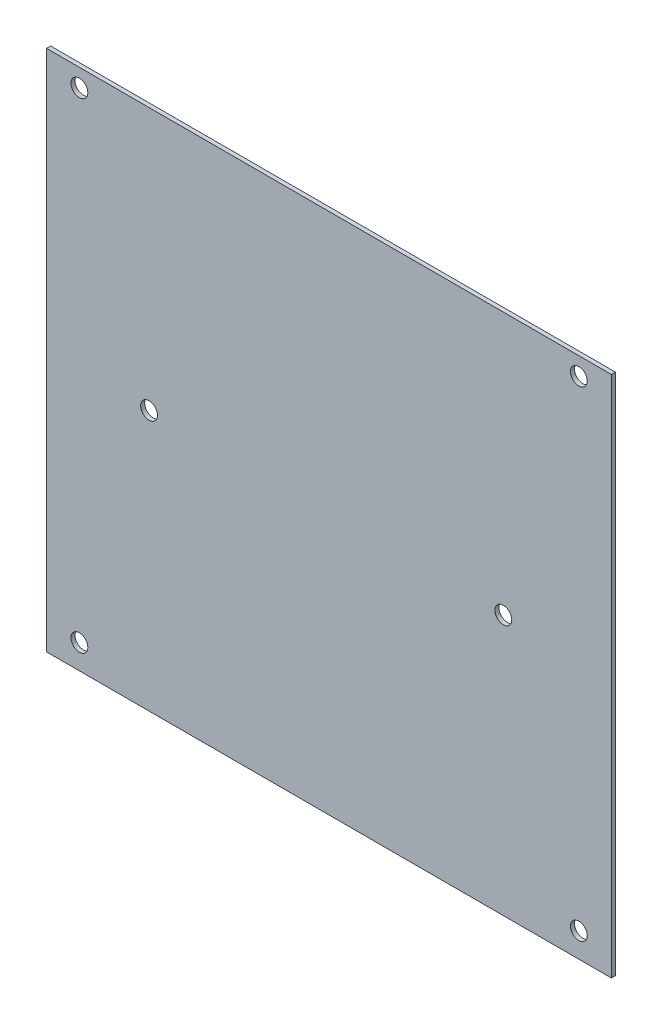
ISO-10303-21;
HEADER;
FILE_DESCRIPTION(('STEP AP214'),'2;1');
FILE_NAME('part.step','',(''),(''),'','','');
FILE_SCHEMA(('AUTOMOTIVE_DESIGN { 1 0 10303 214 1 1 1 1 }'));
ENDSEC;
DATA;
#1=APPLICATION_CONTEXT('core data for automotive mechanical design processes');
#2=APPLICATION_PROTOCOL_DEFINITION('international standard','automotive_design',2000,#1);
#3=PRODUCT_CONTEXT('',#1,'mechanical');
#4=PRODUCT('Part','Part','',(#3));
#5=PRODUCT_RELATED_PRODUCT_CATEGORY('part','',(#4));
#6=PRODUCT_DEFINITION_FORMATION('','',#4);
#7=PRODUCT_DEFINITION_CONTEXT('part definition',#1,'design');
#8=PRODUCT_DEFINITION('design','',#6,#7);
#9=PRODUCT_DEFINITION_SHAPE('','',#8);
#10=(LENGTH_UNIT() NAMED_UNIT(*) SI_UNIT(.MILLI.,.METRE.));
#11=(NAMED_UNIT(*) PLANE_ANGLE_UNIT() SI_UNIT($,.RADIAN.));
#12=(NAMED_UNIT(*) SI_UNIT($,.STERADIAN.) SOLID_ANGLE_UNIT());
#13=UNCERTAINTY_MEASURE_WITH_UNIT(LENGTH_MEASURE(1.E-05),#10,'distance_accuracy_value','');
#14=(GEOMETRIC_REPRESENTATION_CONTEXT(3) GLOBAL_UNCERTAINTY_ASSIGNED_CONTEXT((#13)) GLOBAL_UNIT_ASSIGNED_CONTEXT((#10,
#11,#12)) REPRESENTATION_CONTEXT('',''));
#15=CARTESIAN_POINT('',(0.,0.,0.));
#16=DIRECTION('',(0.,0.,1.));
#17=DIRECTION('',(1.,0.,0.));
#18=AXIS2_PLACEMENT_3D('',#15,#16,#17);
#19=CARTESIAN_POINT('',(0.,0.,2.));
#20=DIRECTION('',(-1.,0.,0.));
#21=DIRECTION('',(0.,0.,1.));
#22=AXIS2_PLACEMENT_3D('',#19,#20,#21);
#23=PLANE('',#22);
#24=DIRECTION('',(0.,-1.,0.));
#25=VECTOR('',#24,1.);
#26=CARTESIAN_POINT('',(0.,90.,0.700000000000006));
#27=LINE('',#26,#25);
#28=CARTESIAN_POINT('',(0.,90.,0.700000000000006));
#29=VERTEX_POINT('',#28);
#30=CARTESIAN_POINT('',(0.,0.,0.700000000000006));
#31=VERTEX_POINT('',#30);
#32=EDGE_CURVE('E77',#29,#31,#27,.T.);
#33=ORIENTED_EDGE('',*,*,#32,.F.);
#34=DIRECTION('',(0.,0.,-1.));
#35=VECTOR('',#34,1.);
#36=CARTESIAN_POINT('',(0.,90.,2.));
#37=LINE('',#36,#35);
#38=CARTESIAN_POINT('',(0.,90.,0.));
#39=VERTEX_POINT('',#38);
#40=EDGE_CURVE('E37',#29,#39,#37,.T.);
#41=ORIENTED_EDGE('',*,*,#40,.T.);
#42=DIRECTION('',(0.,1.,0.));
#43=VECTOR('',#42,1.);
#44=CARTESIAN_POINT('',(0.,0.,0.));
#45=LINE('',#44,#43);
#46=CARTESIAN_POINT('',(0.,0.,0.));
#47=VERTEX_POINT('',#46);
#48=EDGE_CURVE('E98',#47,#39,#45,.T.);
#49=ORIENTED_EDGE('',*,*,#48,.F.);
#50=DIRECTION('',(0.,0.,-1.));
#51=VECTOR('',#50,1.);
#52=CARTESIAN_POINT('',(0.,0.,2.));
#53=LINE('',#52,#51);
#54=EDGE_CURVE('E12',#31,#47,#53,.T.);
#55=ORIENTED_EDGE('',*,*,#54,.F.);
#56=EDGE_LOOP('',(#33,#41,#49,#55));
#57=FACE_BOUND('',#56,.T.);
#58=ADVANCED_FACE('F34',(#57),#23,.T.);
#59=CARTESIAN_POINT('',(0.,0.,2.));
#60=DIRECTION('',(0.,1.,0.));
#61=DIRECTION('',(0.,0.,1.));
#62=AXIS2_PLACEMENT_3D('',#59,#60,#61);
#63=PLANE('',#62);
#64=DIRECTION('',(0.,0.,-1.));
#65=VECTOR('',#64,1.);
#66=CARTESIAN_POINT('',(97.25,0.,2.));
#67=LINE('',#66,#65);
#68=CARTESIAN_POINT('',(97.25,0.,0.700000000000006));
#69=VERTEX_POINT('',#68);
#70=CARTESIAN_POINT('',(97.25,0.,0.));
#71=VERTEX_POINT('',#70);
#72=EDGE_CURVE('E42',#69,#71,#67,.T.);
#73=ORIENTED_EDGE('',*,*,#72,.F.);
#74=DIRECTION('',(1.,0.,0.));
#75=VECTOR('',#74,1.);
#76=CARTESIAN_POINT('',(0.,0.,0.700000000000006));
#77=LINE('',#76,#75);
#78=EDGE_CURVE('E73',#31,#69,#77,.T.);
#79=ORIENTED_EDGE('',*,*,#78,.F.);
#80=ORIENTED_EDGE('',*,*,#54,.T.);
#81=DIRECTION('',(1.,0.,0.));
#82=VECTOR('',#81,1.);
#83=CARTESIAN_POINT('',(0.,0.,0.));
#84=LINE('',#83,#82);
#85=EDGE_CURVE('E88',#47,#71,#84,.T.);
#86=ORIENTED_EDGE('',*,*,#85,.T.);
#87=EDGE_LOOP('',(#73,#79,#80,#86));
#88=FACE_BOUND('',#87,.T.);
#89=ADVANCED_FACE('F87',(#88),#63,.F.);
#90=CARTESIAN_POINT('',(97.25,0.,2.));
#91=DIRECTION('',(-1.,0.,0.));
#92=DIRECTION('',(0.,0.,1.));
#93=AXIS2_PLACEMENT_3D('',#90,#91,#92);
#94=PLANE('',#93);
#95=DIRECTION('',(0.,0.,-1.));
#96=VECTOR('',#95,1.);
#97=CARTESIAN_POINT('',(97.25,90.,2.));
#98=LINE('',#97,#96);
#99=CARTESIAN_POINT('',(97.25,90.,0.700000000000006));
#100=VERTEX_POINT('',#99);
#101=CARTESIAN_POINT('',(97.25,90.,0.));
#102=VERTEX_POINT('',#101);
#103=EDGE_CURVE('E84',#100,#102,#98,.T.);
#104=ORIENTED_EDGE('',*,*,#103,.F.);
#105=DIRECTION('',(0.,1.,0.));
#106=VECTOR('',#105,1.);
#107=CARTESIAN_POINT('',(97.25,90.,0.700000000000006));
#108=LINE('',#107,#106);
#109=EDGE_CURVE('E50',#69,#100,#108,.T.);
#110=ORIENTED_EDGE('',*,*,#109,.F.);
#111=ORIENTED_EDGE('',*,*,#72,.T.);
#112=DIRECTION('',(0.,1.,0.));
#113=VECTOR('',#112,1.);
#114=CARTESIAN_POINT('',(97.25,0.,0.));
#115=LINE('',#114,#113);
#116=EDGE_CURVE('E93',#71,#102,#115,.T.);
#117=ORIENTED_EDGE('',*,*,#116,.T.);
#118=EDGE_LOOP('',(#104,#110,#111,#117));
#119=FACE_BOUND('',#118,.T.);
#120=ADVANCED_FACE('F82',(#119),#94,.F.);
#121=CARTESIAN_POINT('',(0.,90.,2.));
#122=DIRECTION('',(0.,1.,0.));
#123=DIRECTION('',(0.,0.,1.));
#124=AXIS2_PLACEMENT_3D('',#121,#122,#123);
#125=PLANE('',#124);
#126=DIRECTION('',(-1.,0.,0.));
#127=VECTOR('',#126,1.);
#128=CARTESIAN_POINT('',(0.,90.,0.700000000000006));
#129=LINE('',#128,#127);
#130=EDGE_CURVE('E85',#100,#29,#129,.T.);
#131=ORIENTED_EDGE('',*,*,#130,.F.);
#132=ORIENTED_EDGE('',*,*,#103,.T.);
#133=DIRECTION('',(1.,0.,0.));
#134=VECTOR('',#133,1.);
#135=CARTESIAN_POINT('',(0.,90.,0.));
#136=LINE('',#135,#134);
#137=EDGE_CURVE('E95',#39,#102,#136,.T.);
#138=ORIENTED_EDGE('',*,*,#137,.F.);
#139=ORIENTED_EDGE('',*,*,#40,.F.);
#140=EDGE_LOOP('',(#131,#132,#138,#139));
#141=FACE_BOUND('',#140,.T.);
#142=ADVANCED_FACE('F143',(#141),#125,.T.);
#143=CARTESIAN_POINT('',(0.,0.,0.));
#144=DIRECTION('',(0.,0.,-1.));
#145=DIRECTION('',(-1.,0.,0.));
#146=AXIS2_PLACEMENT_3D('',#143,#144,#145);
#147=PLANE('',#146);
#148=CARTESIAN_POINT('',(91.6500000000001,86.925,0.));
#149=DIRECTION('',(0.,0.,1.));
#150=DIRECTION('',(1.,0.,0.));
#151=AXIS2_PLACEMENT_3D('',#148,#149,#150);
#152=CIRCLE('',#151,1.44999999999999);
#153=CARTESIAN_POINT('',(93.1000000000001,86.925,0.));
#154=VERTEX_POINT('',#153);
#155=EDGE_CURVE('E116',#154,#154,#152,.T.);
#156=ORIENTED_EDGE('',*,*,#155,.T.);
#157=EDGE_LOOP('',(#156));
#158=FACE_BOUND('',#157,.T.);
#159=CARTESIAN_POINT('',(5.65000000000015,86.925,0.));
#160=DIRECTION('',(0.,0.,1.));
#161=DIRECTION('',(1.,0.,0.));
#162=AXIS2_PLACEMENT_3D('',#159,#160,#161);
#163=CIRCLE('',#162,1.44999999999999);
#164=CARTESIAN_POINT('',(7.10000000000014,86.925,0.));
#165=VERTEX_POINT('',#164);
#166=EDGE_CURVE('E113',#165,#165,#163,.T.);
#167=ORIENTED_EDGE('',*,*,#166,.T.);
#168=EDGE_LOOP('',(#167));
#169=FACE_BOUND('',#168,.T.);
#170=CARTESIAN_POINT('',(17.6500000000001,44.825,0.));
#171=DIRECTION('',(0.,0.,1.));
#172=DIRECTION('',(1.,0.,0.));
#173=AXIS2_PLACEMENT_3D('',#170,#171,#172);
#174=CIRCLE('',#173,1.44999999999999);
#175=CARTESIAN_POINT('',(19.1000000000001,44.825,0.));
#176=VERTEX_POINT('',#175);
#177=EDGE_CURVE('E110',#176,#176,#174,.T.);
#178=ORIENTED_EDGE('',*,*,#177,.T.);
#179=EDGE_LOOP('',(#178));
#180=FACE_BOUND('',#179,.T.);
#181=CARTESIAN_POINT('',(5.6499999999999,4.22499999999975,0.));
#182=DIRECTION('',(0.,0.,1.));
#183=DIRECTION('',(1.,0.,0.));
#184=AXIS2_PLACEMENT_3D('',#181,#182,#183);
#185=CIRCLE('',#184,1.44999999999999);
#186=CARTESIAN_POINT('',(7.09999999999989,4.22499999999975,0.));
#187=VERTEX_POINT('',#186);
#188=EDGE_CURVE('E107',#187,#187,#185,.T.);
#189=ORIENTED_EDGE('',*,*,#188,.T.);
#190=EDGE_LOOP('',(#189));
#191=FACE_BOUND('',#190,.T.);
#192=CARTESIAN_POINT('',(91.6499999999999,4.22499999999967,0.));
#193=DIRECTION('',(0.,0.,1.));
#194=DIRECTION('',(1.,0.,0.));
#195=AXIS2_PLACEMENT_3D('',#192,#193,#194);
#196=CIRCLE('',#195,1.44999999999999);
#197=CARTESIAN_POINT('',(93.0999999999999,4.22499999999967,0.));
#198=VERTEX_POINT('',#197);
#199=EDGE_CURVE('E104',#198,#198,#196,.T.);
#200=ORIENTED_EDGE('',*,*,#199,.T.);
#201=EDGE_LOOP('',(#200));
#202=FACE_BOUND('',#201,.T.);
#203=CARTESIAN_POINT('',(78.6500000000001,44.825,0.));
#204=DIRECTION('',(0.,0.,1.));
#205=DIRECTION('',(1.,0.,0.));
#206=AXIS2_PLACEMENT_3D('',#203,#204,#205);
#207=CIRCLE('',#206,1.44999999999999);
#208=CARTESIAN_POINT('',(80.1000000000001,44.825,0.));
#209=VERTEX_POINT('',#208);
#210=EDGE_CURVE('E101',#209,#209,#207,.T.);
#211=ORIENTED_EDGE('',*,*,#210,.T.);
#212=EDGE_LOOP('',(#211));
#213=FACE_BOUND('',#212,.T.);
#214=ORIENTED_EDGE('',*,*,#48,.T.);
#215=ORIENTED_EDGE('',*,*,#137,.T.);
#216=ORIENTED_EDGE('',*,*,#116,.F.);
#217=ORIENTED_EDGE('',*,*,#85,.F.);
#218=EDGE_LOOP('',(#214,#215,#216,#217));
#219=FACE_BOUND('',#218,.T.);
#220=ADVANCED_FACE('F145',(#158,#169,#180,#191,#202,#213,#219),#147,.T.);
#221=CARTESIAN_POINT('',(78.6500000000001,44.825,2.));
#222=DIRECTION('',(0.,0.,1.));
#223=DIRECTION('',(1.,0.,0.));
#224=AXIS2_PLACEMENT_3D('',#221,#222,#223);
#225=CYLINDRICAL_SURFACE('',#224,1.44999999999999);
#226=ORIENTED_EDGE('',*,*,#210,.F.);
#227=EDGE_LOOP('',(#226));
#228=FACE_BOUND('',#227,.T.);
#229=CARTESIAN_POINT('',(78.6500000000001,44.825,0.7));
#230=DIRECTION('',(0.,0.,-1.));
#231=DIRECTION('',(-1.,0.,0.));
#232=AXIS2_PLACEMENT_3D('',#229,#230,#231);
#233=CIRCLE('',#232,1.45);
#234=CARTESIAN_POINT('',(77.2000000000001,44.825,0.7));
#235=VERTEX_POINT('',#234);
#236=EDGE_CURVE('E119',#235,#235,#233,.F.);
#237=ORIENTED_EDGE('',*,*,#236,.T.);
#238=EDGE_LOOP('',(#237));
#239=FACE_BOUND('',#238,.T.);
#240=ADVANCED_FACE('F147',(#228,#239),#225,.F.);
#241=CARTESIAN_POINT('',(91.6499999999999,4.22499999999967,2.));
#242=DIRECTION('',(0.,0.,1.));
#243=DIRECTION('',(1.,0.,0.));
#244=AXIS2_PLACEMENT_3D('',#241,#242,#243);
#245=CYLINDRICAL_SURFACE('',#244,1.44999999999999);
#246=ORIENTED_EDGE('',*,*,#199,.F.);
#247=EDGE_LOOP('',(#246));
#248=FACE_BOUND('',#247,.T.);
#249=CARTESIAN_POINT('',(91.6499999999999,4.22499999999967,0.7));
#250=DIRECTION('',(0.,0.,-1.));
#251=DIRECTION('',(-1.,0.,0.));
#252=AXIS2_PLACEMENT_3D('',#249,#250,#251);
#253=CIRCLE('',#252,1.45);
#254=CARTESIAN_POINT('',(90.1999999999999,4.22499999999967,0.7));
#255=VERTEX_POINT('',#254);
#256=EDGE_CURVE('E122',#255,#255,#253,.F.);
#257=ORIENTED_EDGE('',*,*,#256,.T.);
#258=EDGE_LOOP('',(#257));
#259=FACE_BOUND('',#258,.T.);
#260=ADVANCED_FACE('F154',(#248,#259),#245,.F.);
#261=CARTESIAN_POINT('',(5.6499999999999,4.22499999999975,2.));
#262=DIRECTION('',(0.,0.,1.));
#263=DIRECTION('',(1.,0.,0.));
#264=AXIS2_PLACEMENT_3D('',#261,#262,#263);
#265=CYLINDRICAL_SURFACE('',#264,1.44999999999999);
#266=ORIENTED_EDGE('',*,*,#188,.F.);
#267=EDGE_LOOP('',(#266));
#268=FACE_BOUND('',#267,.T.);
#269=CARTESIAN_POINT('',(5.6499999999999,4.22499999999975,0.7));
#270=DIRECTION('',(0.,0.,-1.));
#271=DIRECTION('',(-1.,0.,0.));
#272=AXIS2_PLACEMENT_3D('',#269,#270,#271);
#273=CIRCLE('',#272,1.45);
#274=CARTESIAN_POINT('',(4.1999999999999,4.22499999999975,0.7));
#275=VERTEX_POINT('',#274);
#276=EDGE_CURVE('E125',#275,#275,#273,.F.);
#277=ORIENTED_EDGE('',*,*,#276,.T.);
#278=EDGE_LOOP('',(#277));
#279=FACE_BOUND('',#278,.T.);
#280=ADVANCED_FACE('F208',(#268,#279),#265,.F.);
#281=CARTESIAN_POINT('',(17.6500000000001,44.825,2.));
#282=DIRECTION('',(0.,0.,1.));
#283=DIRECTION('',(1.,0.,0.));
#284=AXIS2_PLACEMENT_3D('',#281,#282,#283);
#285=CYLINDRICAL_SURFACE('',#284,1.44999999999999);
#286=ORIENTED_EDGE('',*,*,#177,.F.);
#287=EDGE_LOOP('',(#286));
#288=FACE_BOUND('',#287,.T.);
#289=CARTESIAN_POINT('',(17.6500000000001,44.825,0.7));
#290=DIRECTION('',(0.,0.,-1.));
#291=DIRECTION('',(-1.,0.,0.));
#292=AXIS2_PLACEMENT_3D('',#289,#290,#291);
#293=CIRCLE('',#292,1.45);
#294=CARTESIAN_POINT('',(16.2000000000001,44.825,0.7));
#295=VERTEX_POINT('',#294);
#296=EDGE_CURVE('E128',#295,#295,#293,.F.);
#297=ORIENTED_EDGE('',*,*,#296,.T.);
#298=EDGE_LOOP('',(#297));
#299=FACE_BOUND('',#298,.T.);
#300=ADVANCED_FACE('F200',(#288,#299),#285,.F.);
#301=CARTESIAN_POINT('',(5.65000000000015,86.925,2.));
#302=DIRECTION('',(0.,0.,1.));
#303=DIRECTION('',(1.,0.,0.));
#304=AXIS2_PLACEMENT_3D('',#301,#302,#303);
#305=CYLINDRICAL_SURFACE('',#304,1.44999999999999);
#306=ORIENTED_EDGE('',*,*,#166,.F.);
#307=EDGE_LOOP('',(#306));
#308=FACE_BOUND('',#307,.T.);
#309=CARTESIAN_POINT('',(5.65000000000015,86.925,0.7));
#310=DIRECTION('',(0.,0.,-1.));
#311=DIRECTION('',(-1.,0.,0.));
#312=AXIS2_PLACEMENT_3D('',#309,#310,#311);
#313=CIRCLE('',#312,1.45);
#314=CARTESIAN_POINT('',(4.20000000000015,86.925,0.7));
#315=VERTEX_POINT('',#314);
#316=EDGE_CURVE('E131',#315,#315,#313,.F.);
#317=ORIENTED_EDGE('',*,*,#316,.T.);
#318=EDGE_LOOP('',(#317));
#319=FACE_BOUND('',#318,.T.);
#320=ADVANCED_FACE('F193',(#308,#319),#305,.F.);
#321=CARTESIAN_POINT('',(91.6500000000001,86.925,2.));
#322=DIRECTION('',(0.,0.,1.));
#323=DIRECTION('',(1.,0.,0.));
#324=AXIS2_PLACEMENT_3D('',#321,#322,#323);
#325=CYLINDRICAL_SURFACE('',#324,1.44999999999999);
#326=ORIENTED_EDGE('',*,*,#155,.F.);
#327=EDGE_LOOP('',(#326));
#328=FACE_BOUND('',#327,.T.);
#329=CARTESIAN_POINT('',(91.6500000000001,86.925,0.7));
#330=DIRECTION('',(0.,0.,-1.));
#331=DIRECTION('',(-1.,0.,0.));
#332=AXIS2_PLACEMENT_3D('',#329,#330,#331);
#333=CIRCLE('',#332,1.45);
#334=CARTESIAN_POINT('',(90.2000000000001,86.925,0.7));
#335=VERTEX_POINT('',#334);
#336=EDGE_CURVE('E134',#335,#335,#333,.F.);
#337=ORIENTED_EDGE('',*,*,#336,.T.);
#338=EDGE_LOOP('',(#337));
#339=FACE_BOUND('',#338,.T.);
#340=ADVANCED_FACE('F182',(#328,#339),#325,.F.);
#341=CARTESIAN_POINT('',(0.,0.,0.7));
#342=DIRECTION('',(0.,0.,-1.));
#343=DIRECTION('',(-1.,0.,0.));
#344=AXIS2_PLACEMENT_3D('',#341,#342,#343);
#345=PLANE('',#344);
#346=ORIENTED_EDGE('',*,*,#256,.F.);
#347=EDGE_LOOP('',(#346));
#348=FACE_BOUND('',#347,.T.);
#349=ORIENTED_EDGE('',*,*,#296,.F.);
#350=EDGE_LOOP('',(#349));
#351=FACE_BOUND('',#350,.T.);
#352=ORIENTED_EDGE('',*,*,#336,.F.);
#353=EDGE_LOOP('',(#352));
#354=FACE_BOUND('',#353,.T.);
#355=ORIENTED_EDGE('',*,*,#32,.T.);
#356=ORIENTED_EDGE('',*,*,#78,.T.);
#357=ORIENTED_EDGE('',*,*,#109,.T.);
#358=ORIENTED_EDGE('',*,*,#130,.T.);
#359=EDGE_LOOP('',(#355,#356,#357,#358));
#360=FACE_BOUND('',#359,.T.);
#361=ORIENTED_EDGE('',*,*,#316,.F.);
#362=EDGE_LOOP('',(#361));
#363=FACE_BOUND('',#362,.T.);
#364=ORIENTED_EDGE('',*,*,#276,.F.);
#365=EDGE_LOOP('',(#364));
#366=FACE_BOUND('',#365,.T.);
#367=ORIENTED_EDGE('',*,*,#236,.F.);
#368=EDGE_LOOP('',(#367));
#369=FACE_BOUND('',#368,.T.);
#370=ADVANCED_FACE('F74',(#348,#351,#354,#360,#363,#366,#369),#345,.F.);
#371=CLOSED_SHELL('',(#58,#89,#120,#142,#220,#240,#260,#280,#300,#320,#340,#370));
#372=MANIFOLD_SOLID_BREP('B2',#371);
#373=ADVANCED_BREP_SHAPE_REPRESENTATION('',(#18,#372),#14);
#374=SHAPE_DEFINITION_REPRESENTATION(#9,#373);
ENDSEC;
END-ISO-10303-21;
